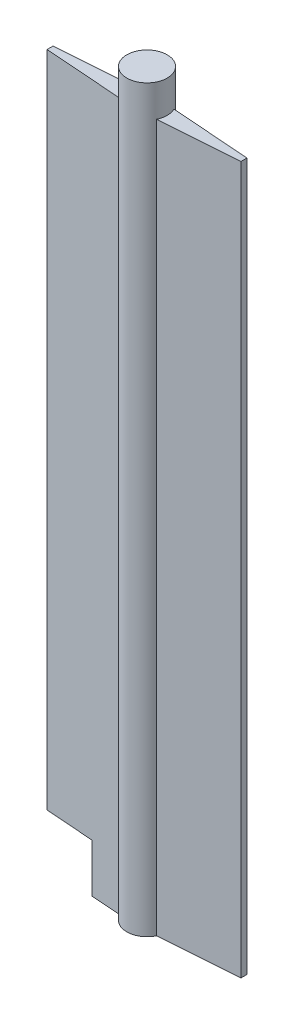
ISO-10303-21;
HEADER;
FILE_DESCRIPTION(('STEP AP214'),'2;1');
FILE_NAME('part.step','',(''),(''),'','','');
FILE_SCHEMA(('AUTOMOTIVE_DESIGN { 1 0 10303 214 1 1 1 1 }'));
ENDSEC;
DATA;
#1=APPLICATION_CONTEXT('core data for automotive mechanical design processes');
#2=APPLICATION_PROTOCOL_DEFINITION('international standard','automotive_design',2000,#1);
#3=PRODUCT_CONTEXT('',#1,'mechanical');
#4=PRODUCT('Part','Part','',(#3));
#5=PRODUCT_RELATED_PRODUCT_CATEGORY('part','',(#4));
#6=PRODUCT_DEFINITION_FORMATION('','',#4);
#7=PRODUCT_DEFINITION_CONTEXT('part definition',#1,'design');
#8=PRODUCT_DEFINITION('design','',#6,#7);
#9=PRODUCT_DEFINITION_SHAPE('','',#8);
#10=(LENGTH_UNIT() NAMED_UNIT(*) SI_UNIT(.MILLI.,.METRE.));
#11=(NAMED_UNIT(*) PLANE_ANGLE_UNIT() SI_UNIT($,.RADIAN.));
#12=(NAMED_UNIT(*) SI_UNIT($,.STERADIAN.) SOLID_ANGLE_UNIT());
#13=UNCERTAINTY_MEASURE_WITH_UNIT(LENGTH_MEASURE(1.E-05),#10,'distance_accuracy_value','');
#14=(GEOMETRIC_REPRESENTATION_CONTEXT(3) GLOBAL_UNCERTAINTY_ASSIGNED_CONTEXT((#13)) GLOBAL_UNIT_ASSIGNED_CONTEXT((#10,
#11,#12)) REPRESENTATION_CONTEXT('',''));
#15=CARTESIAN_POINT('',(0.,0.,0.));
#16=DIRECTION('',(0.,0.,1.));
#17=DIRECTION('',(1.,0.,0.));
#18=AXIS2_PLACEMENT_3D('',#15,#16,#17);
#19=CARTESIAN_POINT('',(0.,222.25,0.));
#20=DIRECTION('',(0.,1.,0.));
#21=DIRECTION('',(0.,0.,1.));
#22=AXIS2_PLACEMENT_3D('',#19,#20,#21);
#23=PLANE('',#22);
#24=CARTESIAN_POINT('',(0.,222.25,0.));
#25=DIRECTION('',(0.,1.,0.));
#26=DIRECTION('',(0.,0.,1.));
#27=AXIS2_PLACEMENT_3D('',#24,#25,#26);
#28=CIRCLE('',#27,6.35);
#29=CARTESIAN_POINT('',(5.71981840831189,222.25,2.75792990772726));
#30=VERTEX_POINT('',#29);
#31=CARTESIAN_POINT('',(5.71981840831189,222.25,-2.75792990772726));
#32=VERTEX_POINT('',#31);
#33=EDGE_CURVE('E175',#30,#32,#28,.T.);
#34=ORIENTED_EDGE('',*,*,#33,.F.);
#35=DIRECTION('',(-0.997352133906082,0.,0.0727235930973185));
#36=VECTOR('',#35,1.);
#37=CARTESIAN_POINT('',(0.230286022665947,222.25,3.15820831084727));
#38=LINE('',#37,#36);
#39=CARTESIAN_POINT('',(30.48,222.25,0.9525));
#40=VERTEX_POINT('',#39);
#41=EDGE_CURVE('E221',#40,#30,#38,.T.);
#42=ORIENTED_EDGE('',*,*,#41,.F.);
#43=DIRECTION('',(0.,0.,1.));
#44=VECTOR('',#43,1.);
#45=CARTESIAN_POINT('',(30.48,222.25,0.));
#46=LINE('',#45,#44);
#47=CARTESIAN_POINT('',(30.48,222.25,-0.952499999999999));
#48=VERTEX_POINT('',#47);
#49=EDGE_CURVE('E226',#48,#40,#46,.T.);
#50=ORIENTED_EDGE('',*,*,#49,.F.);
#51=DIRECTION('',(0.997352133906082,0.,0.0727235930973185));
#52=VECTOR('',#51,1.);
#53=CARTESIAN_POINT('',(0.230286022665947,222.25,-3.15820831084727));
#54=LINE('',#53,#52);
#55=EDGE_CURVE('E217',#32,#48,#54,.T.);
#56=ORIENTED_EDGE('',*,*,#55,.F.);
#57=EDGE_LOOP('',(#34,#42,#50,#56));
#58=FACE_BOUND('',#57,.T.);
#59=ADVANCED_FACE('F69',(#58),#23,.T.);
#60=CARTESIAN_POINT('',(0.230286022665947,222.25,3.15820831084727));
#61=DIRECTION('',(0.0727235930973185,0.,0.997352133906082));
#62=DIRECTION('',(0.997352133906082,0.,-0.0727235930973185));
#63=AXIS2_PLACEMENT_3D('',#60,#61,#62);
#64=PLANE('',#63);
#65=DIRECTION('',(-0.997352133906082,0.,0.0727235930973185));
#66=VECTOR('',#65,1.);
#67=CARTESIAN_POINT('',(0.230286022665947,0.,3.15820831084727));
#68=LINE('',#67,#66);
#69=CARTESIAN_POINT('',(30.48,0.,0.9525));
#70=VERTEX_POINT('',#69);
#71=CARTESIAN_POINT('',(5.71981840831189,0.,2.75792990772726));
#72=VERTEX_POINT('',#71);
#73=EDGE_CURVE('E162',#70,#72,#68,.T.);
#74=ORIENTED_EDGE('',*,*,#73,.F.);
#75=DIRECTION('',(0.,-1.,0.));
#76=VECTOR('',#75,1.);
#77=CARTESIAN_POINT('',(30.48,222.25,0.9525));
#78=LINE('',#77,#76);
#79=EDGE_CURVE('E176',#40,#70,#78,.T.);
#80=ORIENTED_EDGE('',*,*,#79,.F.);
#81=ORIENTED_EDGE('',*,*,#41,.T.);
#82=DIRECTION('',(0.,-1.,0.));
#83=VECTOR('',#82,1.);
#84=CARTESIAN_POINT('',(5.71981840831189,222.25,2.75792990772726));
#85=LINE('',#84,#83);
#86=EDGE_CURVE('E173',#30,#72,#85,.T.);
#87=ORIENTED_EDGE('',*,*,#86,.T.);
#88=EDGE_LOOP('',(#74,#80,#81,#87));
#89=FACE_BOUND('',#88,.T.);
#90=ADVANCED_FACE('F232',(#89),#64,.T.);
#91=CARTESIAN_POINT('',(30.48,222.25,0.));
#92=DIRECTION('',(1.,0.,0.));
#93=DIRECTION('',(0.,0.,-1.));
#94=AXIS2_PLACEMENT_3D('',#91,#92,#93);
#95=PLANE('',#94);
#96=DIRECTION('',(0.,0.,1.));
#97=VECTOR('',#96,1.);
#98=CARTESIAN_POINT('',(30.48,0.,0.));
#99=LINE('',#98,#97);
#100=CARTESIAN_POINT('',(30.48,0.,-0.952499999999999));
#101=VERTEX_POINT('',#100);
#102=EDGE_CURVE('E222',#101,#70,#99,.T.);
#103=ORIENTED_EDGE('',*,*,#102,.F.);
#104=DIRECTION('',(0.,-1.,0.));
#105=VECTOR('',#104,1.);
#106=CARTESIAN_POINT('',(30.48,222.25,-0.952499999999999));
#107=LINE('',#106,#105);
#108=EDGE_CURVE('E214',#48,#101,#107,.T.);
#109=ORIENTED_EDGE('',*,*,#108,.F.);
#110=ORIENTED_EDGE('',*,*,#49,.T.);
#111=ORIENTED_EDGE('',*,*,#79,.T.);
#112=EDGE_LOOP('',(#103,#109,#110,#111));
#113=FACE_BOUND('',#112,.T.);
#114=ADVANCED_FACE('F239',(#113),#95,.T.);
#115=CARTESIAN_POINT('',(0.230286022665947,222.25,-3.15820831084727));
#116=DIRECTION('',(0.0727235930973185,0.,-0.997352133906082));
#117=DIRECTION('',(-0.997352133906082,0.,-0.0727235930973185));
#118=AXIS2_PLACEMENT_3D('',#115,#116,#117);
#119=PLANE('',#118);
#120=DIRECTION('',(0.997352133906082,0.,0.0727235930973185));
#121=VECTOR('',#120,1.);
#122=CARTESIAN_POINT('',(0.230286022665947,0.,-3.15820831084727));
#123=LINE('',#122,#121);
#124=CARTESIAN_POINT('',(5.71981840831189,0.,-2.75792990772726));
#125=VERTEX_POINT('',#124);
#126=EDGE_CURVE('E218',#125,#101,#123,.T.);
#127=ORIENTED_EDGE('',*,*,#126,.F.);
#128=DIRECTION('',(0.,-1.,0.));
#129=VECTOR('',#128,1.);
#130=CARTESIAN_POINT('',(5.71981840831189,222.25,-2.75792990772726));
#131=LINE('',#130,#129);
#132=EDGE_CURVE('E93',#32,#125,#131,.T.);
#133=ORIENTED_EDGE('',*,*,#132,.F.);
#134=ORIENTED_EDGE('',*,*,#55,.T.);
#135=ORIENTED_EDGE('',*,*,#108,.T.);
#136=EDGE_LOOP('',(#127,#133,#134,#135));
#137=FACE_BOUND('',#136,.T.);
#138=ADVANCED_FACE('F236',(#137),#119,.T.);
#139=CARTESIAN_POINT('',(0.,0.,0.));
#140=DIRECTION('',(0.,1.,0.));
#141=DIRECTION('',(0.,0.,1.));
#142=AXIS2_PLACEMENT_3D('',#139,#140,#141);
#143=PLANE('',#142);
#144=DIRECTION('',(0.997352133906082,0.,0.0727235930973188));
#145=VECTOR('',#144,1.);
#146=CARTESIAN_POINT('',(-0.230286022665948,0.,3.15820831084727));
#147=LINE('',#146,#145);
#148=CARTESIAN_POINT('',(-15.24,0.,2.06374999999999));
#149=VERTEX_POINT('',#148);
#150=CARTESIAN_POINT('',(-5.71981840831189,0.,2.75792990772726));
#151=VERTEX_POINT('',#150);
#152=EDGE_CURVE('E131',#149,#151,#147,.T.);
#153=ORIENTED_EDGE('',*,*,#152,.F.);
#154=DIRECTION('',(0.,0.,1.));
#155=VECTOR('',#154,1.);
#156=CARTESIAN_POINT('',(-15.24,0.,-6.35));
#157=LINE('',#156,#155);
#158=CARTESIAN_POINT('',(-15.24,0.,-2.06375));
#159=VERTEX_POINT('',#158);
#160=EDGE_CURVE('E190',#159,#149,#157,.T.);
#161=ORIENTED_EDGE('',*,*,#160,.F.);
#162=DIRECTION('',(-0.997352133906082,0.,0.0727235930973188));
#163=VECTOR('',#162,1.);
#164=CARTESIAN_POINT('',(-0.230286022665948,0.,-3.15820831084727));
#165=LINE('',#164,#163);
#166=CARTESIAN_POINT('',(-5.71981840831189,0.,-2.75792990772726));
#167=VERTEX_POINT('',#166);
#168=EDGE_CURVE('E145',#167,#159,#165,.T.);
#169=ORIENTED_EDGE('',*,*,#168,.F.);
#170=CARTESIAN_POINT('',(0.,0.,0.));
#171=DIRECTION('',(0.,1.,0.));
#172=DIRECTION('',(0.,0.,1.));
#173=AXIS2_PLACEMENT_3D('',#170,#171,#172);
#174=CIRCLE('',#173,6.35);
#175=EDGE_CURVE('E163',#125,#167,#174,.T.);
#176=ORIENTED_EDGE('',*,*,#175,.F.);
#177=ORIENTED_EDGE('',*,*,#126,.T.);
#178=ORIENTED_EDGE('',*,*,#102,.T.);
#179=ORIENTED_EDGE('',*,*,#73,.T.);
#180=EDGE_CURVE('E152',#151,#72,#174,.T.);
#181=ORIENTED_EDGE('',*,*,#180,.F.);
#182=EDGE_LOOP('',(#153,#161,#169,#176,#177,#178,#179,#181));
#183=FACE_BOUND('',#182,.T.);
#184=ADVANCED_FACE('F159',(#183),#143,.F.);
#185=CARTESIAN_POINT('',(-5.71981840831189,222.25,-2.75792990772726));
#186=VERTEX_POINT('',#185);
#187=CARTESIAN_POINT('',(-5.71981840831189,222.25,2.75792990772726));
#188=VERTEX_POINT('',#187);
#189=EDGE_CURVE('E155',#186,#188,#28,.T.);
#190=ORIENTED_EDGE('',*,*,#189,.F.);
#191=DIRECTION('',(-0.997352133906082,0.,0.0727235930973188));
#192=VECTOR('',#191,1.);
#193=CARTESIAN_POINT('',(-0.230286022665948,222.25,-3.15820831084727));
#194=LINE('',#193,#192);
#195=CARTESIAN_POINT('',(-30.48,222.25,-0.952499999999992));
#196=VERTEX_POINT('',#195);
#197=EDGE_CURVE('E144',#186,#196,#194,.T.);
#198=ORIENTED_EDGE('',*,*,#197,.T.);
#199=DIRECTION('',(0.,0.,1.));
#200=VECTOR('',#199,1.);
#201=CARTESIAN_POINT('',(-30.48,222.25,0.));
#202=LINE('',#201,#200);
#203=CARTESIAN_POINT('',(-30.48,222.25,0.952499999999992));
#204=VERTEX_POINT('',#203);
#205=EDGE_CURVE('E210',#196,#204,#202,.T.);
#206=ORIENTED_EDGE('',*,*,#205,.T.);
#207=DIRECTION('',(0.997352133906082,0.,0.0727235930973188));
#208=VECTOR('',#207,1.);
#209=CARTESIAN_POINT('',(-0.230286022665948,222.25,3.15820831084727));
#210=LINE('',#209,#208);
#211=EDGE_CURVE('E157',#204,#188,#210,.T.);
#212=ORIENTED_EDGE('',*,*,#211,.T.);
#213=EDGE_LOOP('',(#190,#198,#206,#212));
#214=FACE_BOUND('',#213,.T.);
#215=ADVANCED_FACE('F247',(#214),#23,.T.);
#216=CARTESIAN_POINT('',(-30.48,222.25,0.));
#217=DIRECTION('',(1.,0.,0.));
#218=DIRECTION('',(0.,0.,-1.));
#219=AXIS2_PLACEMENT_3D('',#216,#217,#218);
#220=PLANE('',#219);
#221=DIRECTION('',(0.,-1.,0.));
#222=VECTOR('',#221,1.);
#223=CARTESIAN_POINT('',(-30.48,222.25,-0.952499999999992));
#224=LINE('',#223,#222);
#225=CARTESIAN_POINT('',(-30.48,15.24,-0.952499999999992));
#226=VERTEX_POINT('',#225);
#227=EDGE_CURVE('E204',#196,#226,#224,.T.);
#228=ORIENTED_EDGE('',*,*,#227,.T.);
#229=DIRECTION('',(0.,0.,1.));
#230=VECTOR('',#229,1.);
#231=CARTESIAN_POINT('',(-30.48,15.24,-6.35));
#232=LINE('',#231,#230);
#233=CARTESIAN_POINT('',(-30.48,15.24,0.952499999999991));
#234=VERTEX_POINT('',#233);
#235=EDGE_CURVE('E187',#226,#234,#232,.T.);
#236=ORIENTED_EDGE('',*,*,#235,.T.);
#237=DIRECTION('',(0.,-1.,0.));
#238=VECTOR('',#237,1.);
#239=CARTESIAN_POINT('',(-30.48,222.25,0.952499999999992));
#240=LINE('',#239,#238);
#241=EDGE_CURVE('E156',#204,#234,#240,.T.);
#242=ORIENTED_EDGE('',*,*,#241,.F.);
#243=ORIENTED_EDGE('',*,*,#205,.F.);
#244=EDGE_LOOP('',(#228,#236,#242,#243));
#245=FACE_BOUND('',#244,.T.);
#246=ADVANCED_FACE('F200',(#245),#220,.F.);
#247=CARTESIAN_POINT('',(-0.230286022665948,222.25,3.15820831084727));
#248=DIRECTION('',(0.0727235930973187,0.,-0.997352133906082));
#249=DIRECTION('',(-0.997352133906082,0.,-0.0727235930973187));
#250=AXIS2_PLACEMENT_3D('',#247,#248,#249);
#251=PLANE('',#250);
#252=ORIENTED_EDGE('',*,*,#241,.T.);
#253=DIRECTION('',(0.997352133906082,0.,0.0727235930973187));
#254=VECTOR('',#253,1.);
#255=CARTESIAN_POINT('',(-0.230286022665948,15.24,3.15820831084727));
#256=LINE('',#255,#254);
#257=CARTESIAN_POINT('',(-15.24,15.24,2.06375));
#258=VERTEX_POINT('',#257);
#259=EDGE_CURVE('E181',#234,#258,#256,.T.);
#260=ORIENTED_EDGE('',*,*,#259,.T.);
#261=DIRECTION('',(0.,-1.,0.));
#262=VECTOR('',#261,1.);
#263=CARTESIAN_POINT('',(-15.24,222.25,2.06375));
#264=LINE('',#263,#262);
#265=EDGE_CURVE('E140',#258,#149,#264,.T.);
#266=ORIENTED_EDGE('',*,*,#265,.T.);
#267=ORIENTED_EDGE('',*,*,#152,.T.);
#268=DIRECTION('',(0.,-1.,0.));
#269=VECTOR('',#268,1.);
#270=CARTESIAN_POINT('',(-5.71981840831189,222.25,2.75792990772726));
#271=LINE('',#270,#269);
#272=EDGE_CURVE('E136',#188,#151,#271,.T.);
#273=ORIENTED_EDGE('',*,*,#272,.F.);
#274=ORIENTED_EDGE('',*,*,#211,.F.);
#275=EDGE_LOOP('',(#252,#260,#266,#267,#273,#274));
#276=FACE_BOUND('',#275,.T.);
#277=ADVANCED_FACE('F134',(#276),#251,.F.);
#278=CARTESIAN_POINT('',(-0.230286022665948,222.25,-3.15820831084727));
#279=DIRECTION('',(0.0727235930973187,0.,0.997352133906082));
#280=DIRECTION('',(0.997352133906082,0.,-0.0727235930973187));
#281=AXIS2_PLACEMENT_3D('',#278,#279,#280);
#282=PLANE('',#281);
#283=DIRECTION('',(0.,1.,0.));
#284=VECTOR('',#283,1.);
#285=CARTESIAN_POINT('',(-15.24,222.25,-2.06375));
#286=LINE('',#285,#284);
#287=CARTESIAN_POINT('',(-15.24,15.24,-2.06375));
#288=VERTEX_POINT('',#287);
#289=EDGE_CURVE('E77',#159,#288,#286,.T.);
#290=ORIENTED_EDGE('',*,*,#289,.T.);
#291=DIRECTION('',(-0.997352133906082,0.,0.0727235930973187));
#292=VECTOR('',#291,1.);
#293=CARTESIAN_POINT('',(-0.230286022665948,15.24,-3.15820831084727));
#294=LINE('',#293,#292);
#295=EDGE_CURVE('E12',#288,#226,#294,.T.);
#296=ORIENTED_EDGE('',*,*,#295,.T.);
#297=ORIENTED_EDGE('',*,*,#227,.F.);
#298=ORIENTED_EDGE('',*,*,#197,.F.);
#299=DIRECTION('',(0.,-1.,0.));
#300=VECTOR('',#299,1.);
#301=CARTESIAN_POINT('',(-5.71981840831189,222.25,-2.75792990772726));
#302=LINE('',#301,#300);
#303=EDGE_CURVE('E169',#186,#167,#302,.T.);
#304=ORIENTED_EDGE('',*,*,#303,.T.);
#305=ORIENTED_EDGE('',*,*,#168,.T.);
#306=EDGE_LOOP('',(#290,#296,#297,#298,#304,#305));
#307=FACE_BOUND('',#306,.T.);
#308=ADVANCED_FACE('F244',(#307),#282,.F.);
#309=CARTESIAN_POINT('',(0.,222.25,0.));
#310=DIRECTION('',(0.,-1.,0.));
#311=DIRECTION('',(0.,0.,-1.));
#312=AXIS2_PLACEMENT_3D('',#309,#310,#311);
#313=CYLINDRICAL_SURFACE('',#312,6.35);
#314=ORIENTED_EDGE('',*,*,#86,.F.);
#315=ORIENTED_EDGE('',*,*,#33,.T.);
#316=ORIENTED_EDGE('',*,*,#132,.T.);
#317=ORIENTED_EDGE('',*,*,#175,.T.);
#318=ORIENTED_EDGE('',*,*,#303,.F.);
#319=ORIENTED_EDGE('',*,*,#189,.T.);
#320=ORIENTED_EDGE('',*,*,#272,.T.);
#321=ORIENTED_EDGE('',*,*,#180,.T.);
#322=EDGE_LOOP('',(#314,#315,#316,#317,#318,#319,#320,#321));
#323=FACE_BOUND('',#322,.T.);
#324=CARTESIAN_POINT('',(0.,232.41,0.));
#325=DIRECTION('',(0.,1.,0.));
#326=DIRECTION('',(0.,0.,1.));
#327=AXIS2_PLACEMENT_3D('',#324,#325,#326);
#328=CIRCLE('',#327,6.35);
#329=CARTESIAN_POINT('',(0.,232.41,6.35));
#330=VERTEX_POINT('',#329);
#331=EDGE_CURVE('E167',#330,#330,#328,.T.);
#332=ORIENTED_EDGE('',*,*,#331,.F.);
#333=EDGE_LOOP('',(#332));
#334=FACE_BOUND('',#333,.T.);
#335=ADVANCED_FACE('F71',(#323,#334),#313,.T.);
#336=CARTESIAN_POINT('',(0.,232.41,0.));
#337=DIRECTION('',(0.,1.,0.));
#338=DIRECTION('',(0.,0.,1.));
#339=AXIS2_PLACEMENT_3D('',#336,#337,#338);
#340=PLANE('',#339);
#341=ORIENTED_EDGE('',*,*,#331,.T.);
#342=EDGE_LOOP('',(#341));
#343=FACE_BOUND('',#342,.T.);
#344=ADVANCED_FACE('F259',(#343),#340,.T.);
#345=CARTESIAN_POINT('',(-30.48,15.24,-6.35));
#346=DIRECTION('',(0.,1.,0.));
#347=DIRECTION('',(0.,0.,1.));
#348=AXIS2_PLACEMENT_3D('',#345,#346,#347);
#349=PLANE('',#348);
#350=ORIENTED_EDGE('',*,*,#235,.F.);
#351=ORIENTED_EDGE('',*,*,#295,.F.);
#352=DIRECTION('',(0.,0.,1.));
#353=VECTOR('',#352,1.);
#354=CARTESIAN_POINT('',(-15.24,15.24,-6.35));
#355=LINE('',#354,#353);
#356=EDGE_CURVE('E84',#288,#258,#355,.T.);
#357=ORIENTED_EDGE('',*,*,#356,.T.);
#358=ORIENTED_EDGE('',*,*,#259,.F.);
#359=EDGE_LOOP('',(#350,#351,#357,#358));
#360=FACE_BOUND('',#359,.T.);
#361=ADVANCED_FACE('F264',(#360),#349,.F.);
#362=CARTESIAN_POINT('',(-15.24,0.,-6.35));
#363=DIRECTION('',(1.,0.,0.));
#364=DIRECTION('',(0.,0.,-1.));
#365=AXIS2_PLACEMENT_3D('',#362,#363,#364);
#366=PLANE('',#365);
#367=ORIENTED_EDGE('',*,*,#356,.F.);
#368=ORIENTED_EDGE('',*,*,#289,.F.);
#369=ORIENTED_EDGE('',*,*,#160,.T.);
#370=ORIENTED_EDGE('',*,*,#265,.F.);
#371=EDGE_LOOP('',(#367,#368,#369,#370));
#372=FACE_BOUND('',#371,.T.);
#373=ADVANCED_FACE('F315',(#372),#366,.F.);
#374=CLOSED_SHELL('',(#59,#90,#114,#138,#184,#215,#246,#277,#308,#335,#344,#361,#373));
#375=MANIFOLD_SOLID_BREP('B2',#374);
#376=ADVANCED_BREP_SHAPE_REPRESENTATION('',(#18,#375),#14);
#377=SHAPE_DEFINITION_REPRESENTATION(#9,#376);
ENDSEC;
END-ISO-10303-21;
